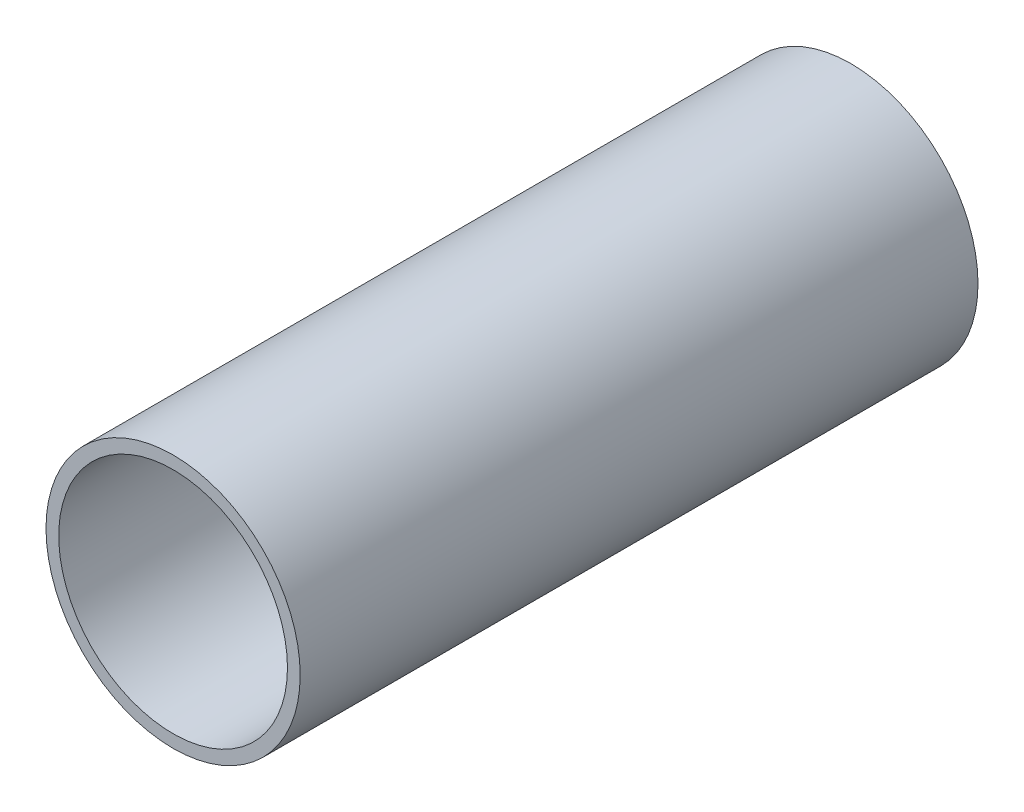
ISO-10303-21;
HEADER;
FILE_DESCRIPTION(('STEP AP214'),'2;1');
FILE_NAME('part.step','',(''),(''),'','','');
FILE_SCHEMA(('AUTOMOTIVE_DESIGN { 1 0 10303 214 1 1 1 1 }'));
ENDSEC;
DATA;
#1=APPLICATION_CONTEXT('core data for automotive mechanical design processes');
#2=APPLICATION_PROTOCOL_DEFINITION('international standard','automotive_design',2000,#1);
#3=PRODUCT_CONTEXT('',#1,'mechanical');
#4=PRODUCT('Part','Part','',(#3));
#5=PRODUCT_RELATED_PRODUCT_CATEGORY('part','',(#4));
#6=PRODUCT_DEFINITION_FORMATION('','',#4);
#7=PRODUCT_DEFINITION_CONTEXT('part definition',#1,'design');
#8=PRODUCT_DEFINITION('design','',#6,#7);
#9=PRODUCT_DEFINITION_SHAPE('','',#8);
#10=(LENGTH_UNIT() NAMED_UNIT(*) SI_UNIT(.MILLI.,.METRE.));
#11=(NAMED_UNIT(*) PLANE_ANGLE_UNIT() SI_UNIT($,.RADIAN.));
#12=(NAMED_UNIT(*) SI_UNIT($,.STERADIAN.) SOLID_ANGLE_UNIT());
#13=UNCERTAINTY_MEASURE_WITH_UNIT(LENGTH_MEASURE(1.E-05),#10,'distance_accuracy_value','');
#14=(GEOMETRIC_REPRESENTATION_CONTEXT(3) GLOBAL_UNCERTAINTY_ASSIGNED_CONTEXT((#13)) GLOBAL_UNIT_ASSIGNED_CONTEXT((#10,
#11,#12)) REPRESENTATION_CONTEXT('',''));
#15=CARTESIAN_POINT('',(0.,0.,0.));
#16=DIRECTION('',(0.,0.,1.));
#17=DIRECTION('',(1.,0.,0.));
#18=AXIS2_PLACEMENT_3D('',#15,#16,#17);
#19=CARTESIAN_POINT('',(0.,0.,80.));
#20=DIRECTION('',(0.,0.,1.));
#21=DIRECTION('',(1.,0.,0.));
#22=AXIS2_PLACEMENT_3D('',#19,#20,#21);
#23=PLANE('',#22);
#24=CARTESIAN_POINT('',(0.,0.,80.));
#25=DIRECTION('',(0.,0.,1.));
#26=DIRECTION('',(1.,0.,0.));
#27=AXIS2_PLACEMENT_3D('',#24,#25,#26);
#28=CIRCLE('',#27,15.);
#29=CARTESIAN_POINT('',(15.,0.,80.));
#30=VERTEX_POINT('',#29);
#31=EDGE_CURVE('E10',#30,#30,#28,.T.);
#32=ORIENTED_EDGE('',*,*,#31,.T.);
#33=EDGE_LOOP('',(#32));
#34=FACE_BOUND('',#33,.T.);
#35=CARTESIAN_POINT('',(0.,0.,80.));
#36=DIRECTION('',(0.,0.,1.));
#37=DIRECTION('',(1.,0.,0.));
#38=AXIS2_PLACEMENT_3D('',#35,#36,#37);
#39=CIRCLE('',#38,13.5);
#40=CARTESIAN_POINT('',(13.5,0.,80.));
#41=VERTEX_POINT('',#40);
#42=EDGE_CURVE('E39',#41,#41,#39,.T.);
#43=ORIENTED_EDGE('',*,*,#42,.F.);
#44=EDGE_LOOP('',(#43));
#45=FACE_BOUND('',#44,.T.);
#46=ADVANCED_FACE('F28',(#34,#45),#23,.T.);
#47=CARTESIAN_POINT('',(0.,0.,0.));
#48=DIRECTION('',(0.,0.,1.));
#49=DIRECTION('',(1.,0.,0.));
#50=AXIS2_PLACEMENT_3D('',#47,#48,#49);
#51=PLANE('',#50);
#52=CARTESIAN_POINT('',(0.,0.,0.));
#53=DIRECTION('',(0.,0.,1.));
#54=DIRECTION('',(1.,0.,0.));
#55=AXIS2_PLACEMENT_3D('',#52,#53,#54);
#56=CIRCLE('',#55,15.);
#57=CARTESIAN_POINT('',(15.,0.,0.));
#58=VERTEX_POINT('',#57);
#59=EDGE_CURVE('E32',#58,#58,#56,.T.);
#60=ORIENTED_EDGE('',*,*,#59,.F.);
#61=EDGE_LOOP('',(#60));
#62=FACE_BOUND('',#61,.T.);
#63=CARTESIAN_POINT('',(0.,0.,0.));
#64=DIRECTION('',(0.,0.,1.));
#65=DIRECTION('',(1.,0.,0.));
#66=AXIS2_PLACEMENT_3D('',#63,#64,#65);
#67=CIRCLE('',#66,13.5);
#68=CARTESIAN_POINT('',(13.5,0.,0.));
#69=VERTEX_POINT('',#68);
#70=EDGE_CURVE('E41',#69,#69,#67,.T.);
#71=ORIENTED_EDGE('',*,*,#70,.T.);
#72=EDGE_LOOP('',(#71));
#73=FACE_BOUND('',#72,.T.);
#74=ADVANCED_FACE('F51',(#62,#73),#51,.F.);
#75=CARTESIAN_POINT('',(0.,0.,80.));
#76=DIRECTION('',(0.,0.,-1.));
#77=DIRECTION('',(-1.,0.,0.));
#78=AXIS2_PLACEMENT_3D('',#75,#76,#77);
#79=CYLINDRICAL_SURFACE('',#78,15.);
#80=ORIENTED_EDGE('',*,*,#31,.F.);
#81=EDGE_LOOP('',(#80));
#82=FACE_BOUND('',#81,.T.);
#83=ORIENTED_EDGE('',*,*,#59,.T.);
#84=EDGE_LOOP('',(#83));
#85=FACE_BOUND('',#84,.T.);
#86=ADVANCED_FACE('F30',(#82,#85),#79,.T.);
#87=CARTESIAN_POINT('',(0.,0.,80.));
#88=DIRECTION('',(0.,0.,-1.));
#89=DIRECTION('',(-1.,0.,0.));
#90=AXIS2_PLACEMENT_3D('',#87,#88,#89);
#91=CYLINDRICAL_SURFACE('',#90,13.5);
#92=ORIENTED_EDGE('',*,*,#42,.T.);
#93=EDGE_LOOP('',(#92));
#94=FACE_BOUND('',#93,.T.);
#95=ORIENTED_EDGE('',*,*,#70,.F.);
#96=EDGE_LOOP('',(#95));
#97=FACE_BOUND('',#96,.T.);
#98=ADVANCED_FACE('F47',(#94,#97),#91,.F.);
#99=CLOSED_SHELL('',(#46,#74,#86,#98));
#100=MANIFOLD_SOLID_BREP('B2',#99);
#101=ADVANCED_BREP_SHAPE_REPRESENTATION('',(#18,#100),#14);
#102=SHAPE_DEFINITION_REPRESENTATION(#9,#101);
ENDSEC;
END-ISO-10303-21;
